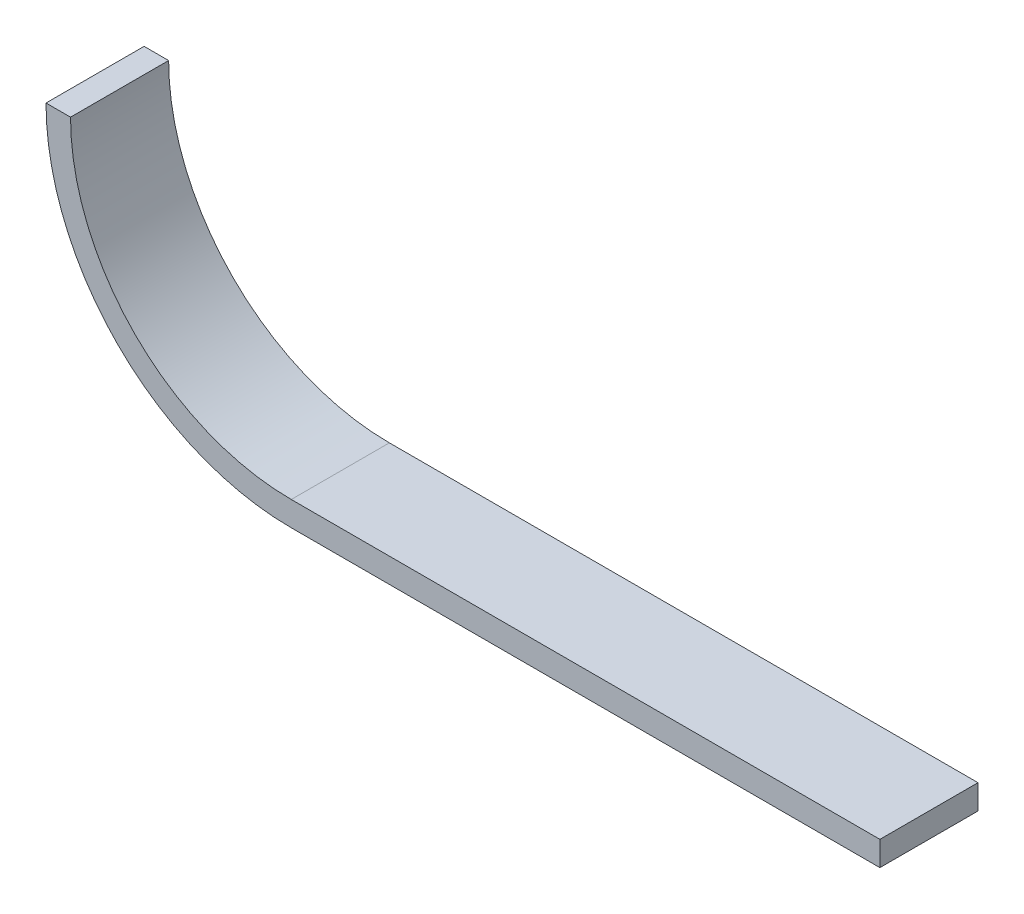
from build123d import *

# Parameters (mm, degrees)
EXTRUDE1_DEPTH = 12.7


with BuildPart() as part:
    # Sketch1 → Extrude1 (new body)
    with BuildSketch(Plane.XY):
        with BuildLine():
            Line((-66.675, 31.75), (-69.85, 31.75))
            ThreePointArc((-69.85, 31.75), (-60.550640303, 9.299359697), (-38.1, 0))
            Line((-38.1, 0), (38.1, 0))
            Line((38.1, 0), (38.1, 3.175))
            Line((38.1, 3.175), (-38.1, 3.175))
            ThreePointArc((-38.1, 3.175), (-58.305576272, 11.544423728), (-66.675, 31.75))
        make_face()
    extrude(amount=EXTRUDE1_DEPTH)


solid = part.part
